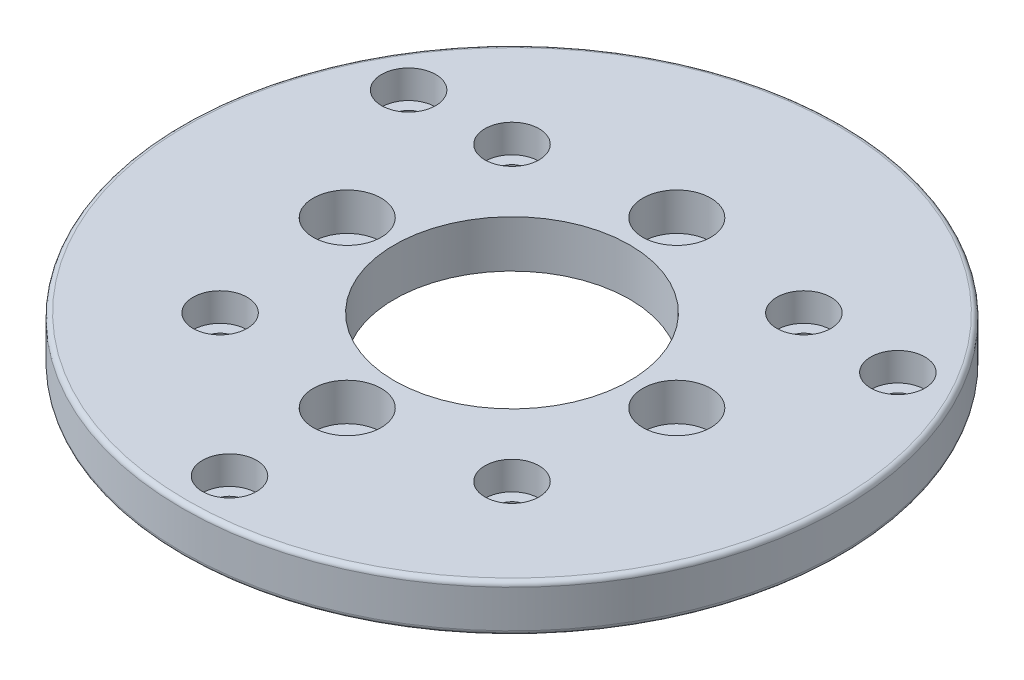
from build123d import *

# Parameters (mm, degrees)
CROQUIS1_R              = 35
CROQUIS1_R_2            = 1.6
CROQUIS1_R_3            = 12.5
CROQUIS1_R_4            = 2.05
SALIENTE_EXTRUIR1_DEPTH = 5
REDONDEO1_R             = 0.5
CROQUIS2_R              = 2.875
CORTAR_EXTRUIR1_DEPTH   = 3
CROQUIS3_R              = 3.61
CORTAR_EXTRUIR2_DEPTH   = 4


with BuildPart() as part:
    # Croquis1 → Saliente-Extruir1 (new body)
    with BuildSketch(Plane(origin=(0, 0, 0), x_dir=(1, 0, 0), z_dir=(0, 1, 0))):
        with Locations(Location((0, 0, 0), (0, 0, 270))):
            Circle(CROQUIS1_R)
        with Locations(Location((-25.980762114, 15, 0), (0, 0, 270))):
            Circle(CROQUIS1_R_2, mode=Mode.SUBTRACT)
        with Locations(Location((25.980762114, 15, 0), (0, 0, 270))):
            Circle(CROQUIS1_R_2, mode=Mode.SUBTRACT)
        with Locations(Location((0, -30, 0), (0, 0, 270))):
            Circle(CROQUIS1_R_2, mode=Mode.SUBTRACT)
        with Locations(Location((0, 0, 0), (0, 0, 270))):
            Circle(CROQUIS1_R_3, mode=Mode.SUBTRACT)
        with Locations(Location((-15.5, 15.5, 0), (0, 0, 270))):
            Circle(CROQUIS1_R_2, mode=Mode.SUBTRACT)
        with Locations(Location((15.5, 15.5, 0), (0, 0, 270))):
            Circle(CROQUIS1_R_2, mode=Mode.SUBTRACT)
        with Locations(Location((15.5, -15.5, 0), (0, 0, 270))):
            Circle(CROQUIS1_R_2, mode=Mode.SUBTRACT)
        with Locations(Location((-15.5, -15.5, 0), (0, 0, 270))):
            Circle(CROQUIS1_R_2, mode=Mode.SUBTRACT)
        with Locations(Location((17.5, 0, 0), (0, 0, 270))):
            Circle(CROQUIS1_R_4, mode=Mode.SUBTRACT)
        with Locations(Location((0, 17.5, 0), (0, 0, 270))):
            Circle(CROQUIS1_R_4, mode=Mode.SUBTRACT)
        with Locations(Location((-17.5, 0, 0), (0, 0, 270))):
            Circle(CROQUIS1_R_4, mode=Mode.SUBTRACT)
        with Locations(Location((0, -17.5, 0), (0, 0, 270))):
            Circle(CROQUIS1_R_4, mode=Mode.SUBTRACT)
    extrude(amount=SALIENTE_EXTRUIR1_DEPTH)

    # Redondeo1
    redondeo1_edges = [part.edges().sort_by_distance(p)[0] for p in [
        (0, 0, -35),
        (0, 5, -35),
    ]]
    fillet(redondeo1_edges, radius=REDONDEO1_R)

    # Croquis2 → Cortar-Extruir1 (cut)
    with BuildSketch(Plane(origin=(0, 5, 0), x_dir=(1, 0, 0), z_dir=(0, 1, 0))):
        with Locations(Location((-25.980762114, 15, 0), (0, 0, 270))):
            Circle(CROQUIS2_R)
        with Locations(Location((25.980762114, 15, 0), (0, 0, 270))):
            Circle(CROQUIS2_R)
        with Locations(Location((0, -30, 0), (0, 0, 270))):
            Circle(CROQUIS2_R)
        with Locations(Location((-15.5, 15.5, 0), (0, 0, 270))):
            Circle(CROQUIS2_R)
        with Locations(Location((15.5, 15.5, 0), (0, 0, 270))):
            Circle(CROQUIS2_R)
        with Locations(Location((15.5, -15.5, 0), (0, 0, 270))):
            Circle(CROQUIS2_R)
        with Locations(Location((-15.5, -15.5, 0), (0, 0, 270))):
            Circle(CROQUIS2_R)
    extrude(amount=-CORTAR_EXTRUIR1_DEPTH, mode=Mode.SUBTRACT)

    # Croquis3 → Cortar-Extruir2 (cut)
    with BuildSketch(Plane(origin=(0, 5, 0), x_dir=(1, 0, 0), z_dir=(0, 1, 0))):
        with Locations(Location((0, 17.5, 0), (0, 0, 270))):
            Circle(CROQUIS3_R)
        with Locations(Location((17.5, 0, 0), (0, 0, 270))):
            Circle(CROQUIS3_R)
        with Locations(Location((0, -17.5, 0), (0, 0, 270))):
            Circle(CROQUIS3_R)
        with Locations(Location((-17.5, 0, 0), (0, 0, 270))):
            Circle(CROQUIS3_R)
    extrude(amount=-CORTAR_EXTRUIR2_DEPTH, mode=Mode.SUBTRACT)


solid = part.part
